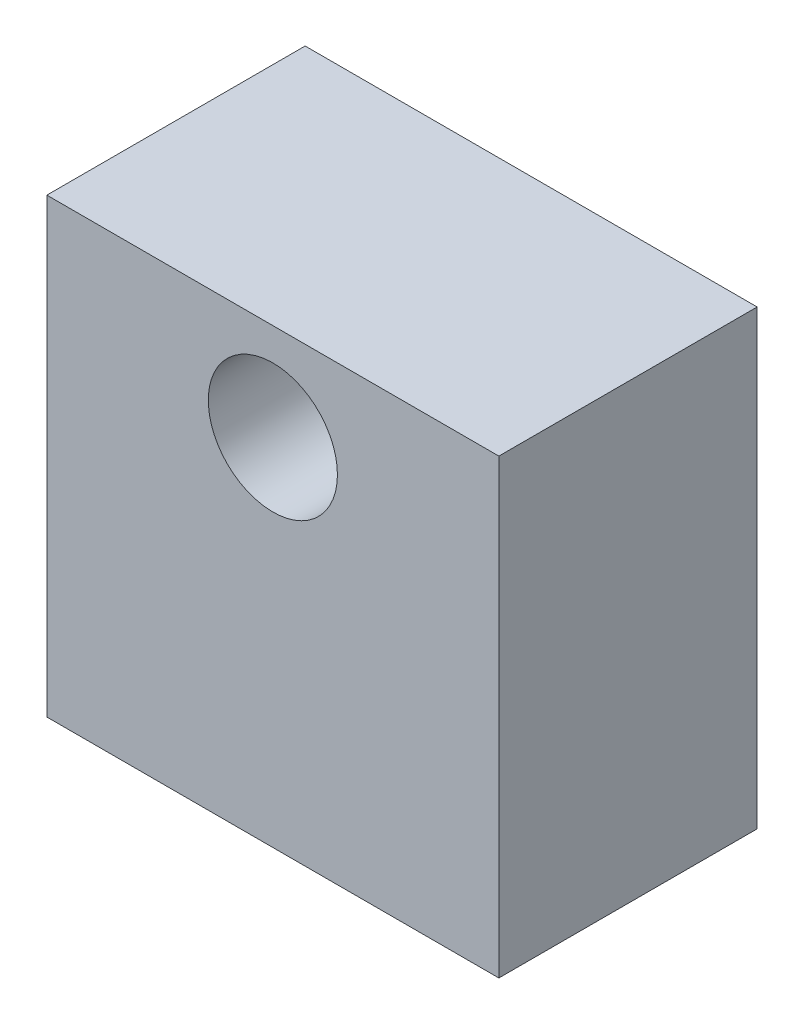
from build123d import *

# Parameters (mm, degrees)
SKETCH_1_W      = 70
SKETCH_1_H      = 70
SKETCH_1_R      = 10
EXTRUDE_1_DEPTH = 40


with BuildPart() as part:
    # Sketch 1 → Extrude 1 (new body)
    with BuildSketch(Plane.XY):
        Rectangle(SKETCH_1_W, SKETCH_1_H)
        with Locations((0, 20)):
            Circle(SKETCH_1_R, mode=Mode.SUBTRACT)
    extrude(amount=EXTRUDE_1_DEPTH)


solid = part.part
